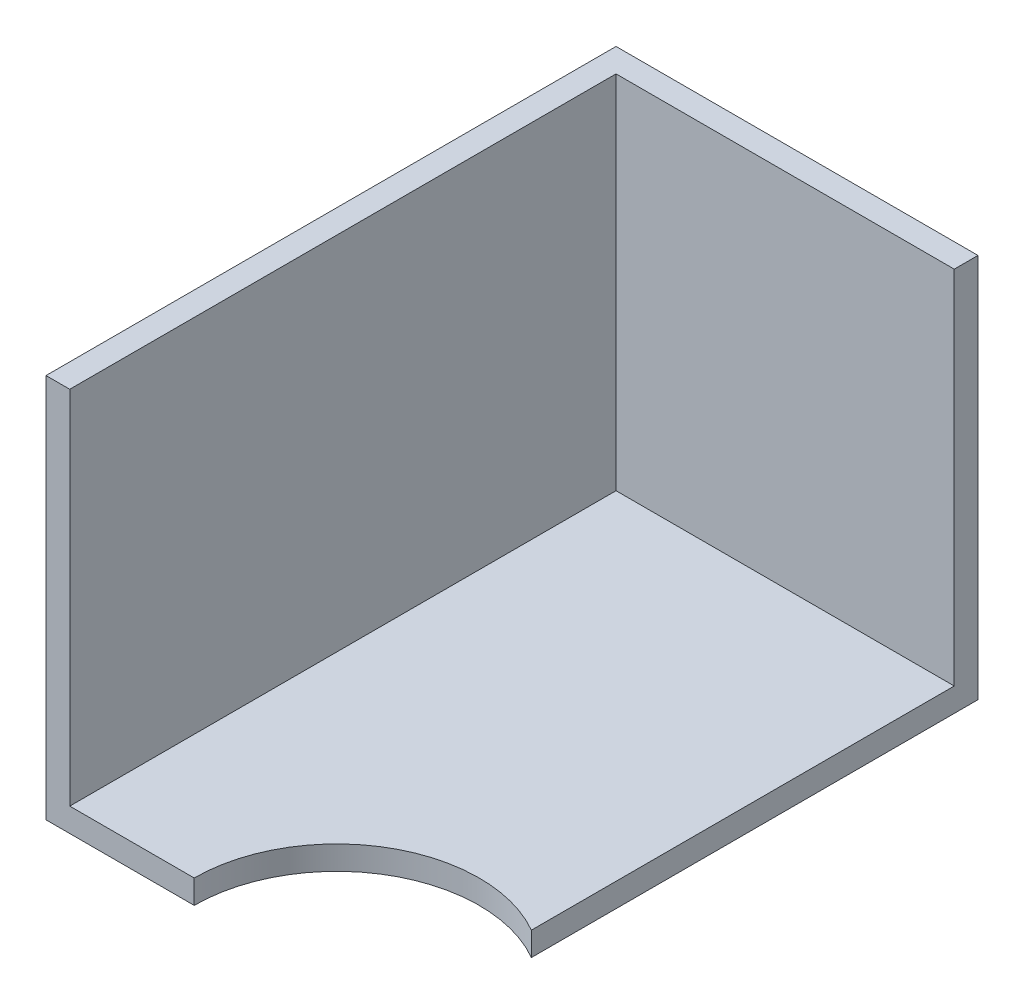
ISO-10303-21;
HEADER;
FILE_DESCRIPTION(('STEP AP214'),'2;1');
FILE_NAME('part.step','',(''),(''),'','','');
FILE_SCHEMA(('AUTOMOTIVE_DESIGN { 1 0 10303 214 1 1 1 1 }'));
ENDSEC;
DATA;
#1=APPLICATION_CONTEXT('core data for automotive mechanical design processes');
#2=APPLICATION_PROTOCOL_DEFINITION('international standard','automotive_design',2000,#1);
#3=PRODUCT_CONTEXT('',#1,'mechanical');
#4=PRODUCT('Part','Part','',(#3));
#5=PRODUCT_RELATED_PRODUCT_CATEGORY('part','',(#4));
#6=PRODUCT_DEFINITION_FORMATION('','',#4);
#7=PRODUCT_DEFINITION_CONTEXT('part definition',#1,'design');
#8=PRODUCT_DEFINITION('design','',#6,#7);
#9=PRODUCT_DEFINITION_SHAPE('','',#8);
#10=(LENGTH_UNIT() NAMED_UNIT(*) SI_UNIT(.MILLI.,.METRE.));
#11=(NAMED_UNIT(*) PLANE_ANGLE_UNIT() SI_UNIT($,.RADIAN.));
#12=(NAMED_UNIT(*) SI_UNIT($,.STERADIAN.) SOLID_ANGLE_UNIT());
#13=UNCERTAINTY_MEASURE_WITH_UNIT(LENGTH_MEASURE(1.E-05),#10,'distance_accuracy_value','');
#14=(GEOMETRIC_REPRESENTATION_CONTEXT(3) GLOBAL_UNCERTAINTY_ASSIGNED_CONTEXT((#13)) GLOBAL_UNIT_ASSIGNED_CONTEXT((#10,
#11,#12)) REPRESENTATION_CONTEXT('',''));
#15=CARTESIAN_POINT('',(0.,0.,0.));
#16=DIRECTION('',(0.,0.,1.));
#17=DIRECTION('',(1.,0.,0.));
#18=AXIS2_PLACEMENT_3D('',#15,#16,#17);
#19=CARTESIAN_POINT('',(-38.1,5.,60.));
#20=DIRECTION('',(1.,0.,0.));
#21=DIRECTION('',(0.,0.,-1.));
#22=AXIS2_PLACEMENT_3D('',#19,#20,#21);
#23=PLANE('',#22);
#24=DIRECTION('',(0.,0.,1.));
#25=VECTOR('',#24,1.);
#26=CARTESIAN_POINT('',(-38.1,0.,60.));
#27=LINE('',#26,#25);
#28=CARTESIAN_POINT('',(-38.1,0.,-60.));
#29=VERTEX_POINT('',#28);
#30=CARTESIAN_POINT('',(-38.1,0.,60.));
#31=VERTEX_POINT('',#30);
#32=EDGE_CURVE('E121',#29,#31,#27,.T.);
#33=ORIENTED_EDGE('',*,*,#32,.T.);
#34=DIRECTION('',(0.,-1.,0.));
#35=VECTOR('',#34,1.);
#36=CARTESIAN_POINT('',(-38.1,5.,60.));
#37=LINE('',#36,#35);
#38=CARTESIAN_POINT('',(-38.1,81.,60.));
#39=VERTEX_POINT('',#38);
#40=EDGE_CURVE('E11',#39,#31,#37,.T.);
#41=ORIENTED_EDGE('',*,*,#40,.F.);
#42=DIRECTION('',(0.,0.,1.));
#43=VECTOR('',#42,1.);
#44=CARTESIAN_POINT('',(-38.1,81.,60.));
#45=LINE('',#44,#43);
#46=CARTESIAN_POINT('',(-38.1,81.,-60.));
#47=VERTEX_POINT('',#46);
#48=EDGE_CURVE('E158',#47,#39,#45,.T.);
#49=ORIENTED_EDGE('',*,*,#48,.F.);
#50=DIRECTION('',(0.,-1.,0.));
#51=VECTOR('',#50,1.);
#52=CARTESIAN_POINT('',(-38.1,5.,-60.));
#53=LINE('',#52,#51);
#54=EDGE_CURVE('E125',#47,#29,#53,.T.);
#55=ORIENTED_EDGE('',*,*,#54,.T.);
#56=EDGE_LOOP('',(#33,#41,#49,#55));
#57=FACE_BOUND('',#56,.T.);
#58=ADVANCED_FACE('F34',(#57),#23,.F.);
#59=CARTESIAN_POINT('',(38.1,5.,60.));
#60=DIRECTION('',(0.,0.,-1.));
#61=DIRECTION('',(-1.,0.,0.));
#62=AXIS2_PLACEMENT_3D('',#59,#60,#61);
#63=PLANE('',#62);
#64=DIRECTION('',(1.,0.,0.));
#65=VECTOR('',#64,1.);
#66=CARTESIAN_POINT('',(38.1,0.,60.));
#67=LINE('',#66,#65);
#68=CARTESIAN_POINT('',(-6.89999999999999,0.,60.));
#69=VERTEX_POINT('',#68);
#70=EDGE_CURVE('E117',#31,#69,#67,.T.);
#71=ORIENTED_EDGE('',*,*,#70,.T.);
#72=DIRECTION('',(0.,1.,0.));
#73=VECTOR('',#72,1.);
#74=CARTESIAN_POINT('',(-6.89999999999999,0.,60.));
#75=LINE('',#74,#73);
#76=CARTESIAN_POINT('',(-6.89999999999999,5.,60.));
#77=VERTEX_POINT('',#76);
#78=EDGE_CURVE('E51',#69,#77,#75,.T.);
#79=ORIENTED_EDGE('',*,*,#78,.T.);
#80=DIRECTION('',(1.,0.,0.));
#81=VECTOR('',#80,1.);
#82=CARTESIAN_POINT('',(38.1,5.,60.));
#83=LINE('',#82,#81);
#84=CARTESIAN_POINT('',(-33.0999999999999,5.,60.));
#85=VERTEX_POINT('',#84);
#86=EDGE_CURVE('E119',#85,#77,#83,.T.);
#87=ORIENTED_EDGE('',*,*,#86,.F.);
#88=DIRECTION('',(0.,-1.,0.));
#89=VECTOR('',#88,1.);
#90=CARTESIAN_POINT('',(-33.1,81.,60.));
#91=LINE('',#90,#89);
#92=CARTESIAN_POINT('',(-33.1,81.,60.));
#93=VERTEX_POINT('',#92);
#94=EDGE_CURVE('E140',#93,#85,#91,.T.);
#95=ORIENTED_EDGE('',*,*,#94,.F.);
#96=DIRECTION('',(1.,0.,0.));
#97=VECTOR('',#96,1.);
#98=CARTESIAN_POINT('',(-33.1,81.,60.));
#99=LINE('',#98,#97);
#100=EDGE_CURVE('E155',#39,#93,#99,.T.);
#101=ORIENTED_EDGE('',*,*,#100,.F.);
#102=ORIENTED_EDGE('',*,*,#40,.T.);
#103=EDGE_LOOP('',(#71,#79,#87,#95,#101,#102));
#104=FACE_BOUND('',#103,.T.);
#105=ADVANCED_FACE('F176',(#104),#63,.F.);
#106=CARTESIAN_POINT('',(38.1,5.,60.));
#107=DIRECTION('',(-1.,0.,0.));
#108=DIRECTION('',(0.,0.,1.));
#109=AXIS2_PLACEMENT_3D('',#106,#107,#108);
#110=PLANE('',#109);
#111=DIRECTION('',(0.,0.,-1.));
#112=VECTOR('',#111,1.);
#113=CARTESIAN_POINT('',(38.1,5.,60.));
#114=LINE('',#113,#112);
#115=CARTESIAN_POINT('',(38.1,5.,34.0192378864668));
#116=VERTEX_POINT('',#115);
#117=CARTESIAN_POINT('',(38.1,5.,-55.));
#118=VERTEX_POINT('',#117);
#119=EDGE_CURVE('E37',#116,#118,#114,.T.);
#120=ORIENTED_EDGE('',*,*,#119,.F.);
#121=DIRECTION('',(0.,1.,0.));
#122=VECTOR('',#121,1.);
#123=CARTESIAN_POINT('',(38.1,0.,34.0192378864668));
#124=LINE('',#123,#122);
#125=CARTESIAN_POINT('',(38.1,0.,34.0192378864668));
#126=VERTEX_POINT('',#125);
#127=EDGE_CURVE('E101',#116,#126,#124,.F.);
#128=ORIENTED_EDGE('',*,*,#127,.T.);
#129=DIRECTION('',(0.,0.,-1.));
#130=VECTOR('',#129,1.);
#131=CARTESIAN_POINT('',(38.1,0.,60.));
#132=LINE('',#131,#130);
#133=CARTESIAN_POINT('',(38.1,0.,-60.));
#134=VERTEX_POINT('',#133);
#135=EDGE_CURVE('E109',#126,#134,#132,.T.);
#136=ORIENTED_EDGE('',*,*,#135,.T.);
#137=DIRECTION('',(0.,-1.,0.));
#138=VECTOR('',#137,1.);
#139=CARTESIAN_POINT('',(38.1,5.,-60.));
#140=LINE('',#139,#138);
#141=CARTESIAN_POINT('',(38.1,81.,-60.));
#142=VERTEX_POINT('',#141);
#143=EDGE_CURVE('E43',#142,#134,#140,.T.);
#144=ORIENTED_EDGE('',*,*,#143,.F.);
#145=DIRECTION('',(0.,0.,-1.));
#146=VECTOR('',#145,1.);
#147=CARTESIAN_POINT('',(38.1,81.,-60.));
#148=LINE('',#147,#146);
#149=CARTESIAN_POINT('',(38.1,81.,-55.));
#150=VERTEX_POINT('',#149);
#151=EDGE_CURVE('E164',#150,#142,#148,.T.);
#152=ORIENTED_EDGE('',*,*,#151,.F.);
#153=DIRECTION('',(0.,-1.,0.));
#154=VECTOR('',#153,1.);
#155=CARTESIAN_POINT('',(38.1,81.,-55.));
#156=LINE('',#155,#154);
#157=EDGE_CURVE('E148',#150,#118,#156,.T.);
#158=ORIENTED_EDGE('',*,*,#157,.T.);
#159=EDGE_LOOP('',(#120,#128,#136,#144,#152,#158));
#160=FACE_BOUND('',#159,.T.);
#161=ADVANCED_FACE('F108',(#160),#110,.F.);
#162=CARTESIAN_POINT('',(38.1,5.,-60.));
#163=DIRECTION('',(0.,0.,1.));
#164=DIRECTION('',(1.,0.,0.));
#165=AXIS2_PLACEMENT_3D('',#162,#163,#164);
#166=PLANE('',#165);
#167=DIRECTION('',(-1.,0.,0.));
#168=VECTOR('',#167,1.);
#169=CARTESIAN_POINT('',(38.1,0.,-60.));
#170=LINE('',#169,#168);
#171=EDGE_CURVE('E116',#134,#29,#170,.T.);
#172=ORIENTED_EDGE('',*,*,#171,.T.);
#173=ORIENTED_EDGE('',*,*,#54,.F.);
#174=DIRECTION('',(-1.,0.,0.));
#175=VECTOR('',#174,1.);
#176=CARTESIAN_POINT('',(-38.1,81.,-60.));
#177=LINE('',#176,#175);
#178=EDGE_CURVE('E161',#142,#47,#177,.T.);
#179=ORIENTED_EDGE('',*,*,#178,.F.);
#180=ORIENTED_EDGE('',*,*,#143,.T.);
#181=EDGE_LOOP('',(#172,#173,#179,#180));
#182=FACE_BOUND('',#181,.T.);
#183=ADVANCED_FACE('F191',(#182),#166,.F.);
#184=CARTESIAN_POINT('',(0.,5.,0.));
#185=DIRECTION('',(0.,1.,0.));
#186=DIRECTION('',(0.,0.,1.));
#187=AXIS2_PLACEMENT_3D('',#184,#185,#186);
#188=PLANE('',#187);
#189=CARTESIAN_POINT('',(23.1,5.,60.));
#190=DIRECTION('',(0.,1.,0.));
#191=DIRECTION('',(0.,0.,1.));
#192=AXIS2_PLACEMENT_3D('',#189,#190,#191);
#193=CIRCLE('',#192,30.);
#194=EDGE_CURVE('E105',#116,#77,#193,.T.);
#195=ORIENTED_EDGE('',*,*,#194,.F.);
#196=ORIENTED_EDGE('',*,*,#119,.T.);
#197=DIRECTION('',(1.,0.,0.));
#198=VECTOR('',#197,1.);
#199=CARTESIAN_POINT('',(38.1,5.,-55.));
#200=LINE('',#199,#198);
#201=CARTESIAN_POINT('',(-33.1,5.,-55.));
#202=VERTEX_POINT('',#201);
#203=EDGE_CURVE('E153',#202,#118,#200,.T.);
#204=ORIENTED_EDGE('',*,*,#203,.F.);
#205=DIRECTION('',(0.,0.,-1.));
#206=VECTOR('',#205,1.);
#207=CARTESIAN_POINT('',(-33.1,5.,-55.));
#208=LINE('',#207,#206);
#209=EDGE_CURVE('E132',#85,#202,#208,.T.);
#210=ORIENTED_EDGE('',*,*,#209,.F.);
#211=ORIENTED_EDGE('',*,*,#86,.T.);
#212=EDGE_LOOP('',(#195,#196,#204,#210,#211));
#213=FACE_BOUND('',#212,.T.);
#214=ADVANCED_FACE('F177',(#213),#188,.T.);
#215=CARTESIAN_POINT('',(0.,0.,0.));
#216=DIRECTION('',(0.,1.,0.));
#217=DIRECTION('',(0.,0.,1.));
#218=AXIS2_PLACEMENT_3D('',#215,#216,#217);
#219=PLANE('',#218);
#220=ORIENTED_EDGE('',*,*,#135,.F.);
#221=CARTESIAN_POINT('',(23.1,0.,60.));
#222=DIRECTION('',(0.,1.,0.));
#223=DIRECTION('',(0.,0.,1.));
#224=AXIS2_PLACEMENT_3D('',#221,#222,#223);
#225=CIRCLE('',#224,30.);
#226=EDGE_CURVE('E98',#126,#69,#225,.T.);
#227=ORIENTED_EDGE('',*,*,#226,.T.);
#228=ORIENTED_EDGE('',*,*,#70,.F.);
#229=ORIENTED_EDGE('',*,*,#32,.F.);
#230=ORIENTED_EDGE('',*,*,#171,.F.);
#231=EDGE_LOOP('',(#220,#227,#228,#229,#230));
#232=FACE_BOUND('',#231,.T.);
#233=ADVANCED_FACE('F114',(#232),#219,.F.);
#234=CARTESIAN_POINT('',(-33.1,81.,-55.));
#235=DIRECTION('',(-1.,0.,0.));
#236=DIRECTION('',(0.,0.,1.));
#237=AXIS2_PLACEMENT_3D('',#234,#235,#236);
#238=PLANE('',#237);
#239=ORIENTED_EDGE('',*,*,#209,.T.);
#240=DIRECTION('',(0.,-1.,0.));
#241=VECTOR('',#240,1.);
#242=CARTESIAN_POINT('',(-33.1,81.,-55.));
#243=LINE('',#242,#241);
#244=CARTESIAN_POINT('',(-33.1,81.,-55.));
#245=VERTEX_POINT('',#244);
#246=EDGE_CURVE('E136',#245,#202,#243,.T.);
#247=ORIENTED_EDGE('',*,*,#246,.F.);
#248=DIRECTION('',(0.,0.,-1.));
#249=VECTOR('',#248,1.);
#250=CARTESIAN_POINT('',(-33.1,81.,-55.));
#251=LINE('',#250,#249);
#252=EDGE_CURVE('E169',#93,#245,#251,.T.);
#253=ORIENTED_EDGE('',*,*,#252,.F.);
#254=ORIENTED_EDGE('',*,*,#94,.T.);
#255=EDGE_LOOP('',(#239,#247,#253,#254));
#256=FACE_BOUND('',#255,.T.);
#257=ADVANCED_FACE('F179',(#256),#238,.F.);
#258=CARTESIAN_POINT('',(38.1,81.,-55.));
#259=DIRECTION('',(0.,0.,-1.));
#260=DIRECTION('',(-1.,0.,0.));
#261=AXIS2_PLACEMENT_3D('',#258,#259,#260);
#262=PLANE('',#261);
#263=ORIENTED_EDGE('',*,*,#203,.T.);
#264=ORIENTED_EDGE('',*,*,#157,.F.);
#265=DIRECTION('',(1.,0.,0.));
#266=VECTOR('',#265,1.);
#267=CARTESIAN_POINT('',(38.1,81.,-55.));
#268=LINE('',#267,#266);
#269=EDGE_CURVE('E167',#245,#150,#268,.T.);
#270=ORIENTED_EDGE('',*,*,#269,.F.);
#271=ORIENTED_EDGE('',*,*,#246,.T.);
#272=EDGE_LOOP('',(#263,#264,#270,#271));
#273=FACE_BOUND('',#272,.T.);
#274=ADVANCED_FACE('F182',(#273),#262,.F.);
#275=CARTESIAN_POINT('',(0.,81.,0.));
#276=DIRECTION('',(0.,-1.,0.));
#277=DIRECTION('',(0.,0.,-1.));
#278=AXIS2_PLACEMENT_3D('',#275,#276,#277);
#279=PLANE('',#278);
#280=ORIENTED_EDGE('',*,*,#100,.T.);
#281=ORIENTED_EDGE('',*,*,#252,.T.);
#282=ORIENTED_EDGE('',*,*,#269,.T.);
#283=ORIENTED_EDGE('',*,*,#151,.T.);
#284=ORIENTED_EDGE('',*,*,#178,.T.);
#285=ORIENTED_EDGE('',*,*,#48,.T.);
#286=EDGE_LOOP('',(#280,#281,#282,#283,#284,#285));
#287=FACE_BOUND('',#286,.T.);
#288=ADVANCED_FACE('F186',(#287),#279,.F.);
#289=CARTESIAN_POINT('',(23.1,0.,60.));
#290=DIRECTION('',(0.,1.,0.));
#291=DIRECTION('',(0.,0.,1.));
#292=AXIS2_PLACEMENT_3D('',#289,#290,#291);
#293=CYLINDRICAL_SURFACE('',#292,30.);
#294=ORIENTED_EDGE('',*,*,#226,.F.);
#295=ORIENTED_EDGE('',*,*,#127,.F.);
#296=ORIENTED_EDGE('',*,*,#194,.T.);
#297=ORIENTED_EDGE('',*,*,#78,.F.);
#298=EDGE_LOOP('',(#294,#295,#296,#297));
#299=FACE_BOUND('',#298,.T.);
#300=ADVANCED_FACE('F100',(#299),#293,.F.);
#301=CLOSED_SHELL('',(#58,#105,#161,#183,#214,#233,#257,#274,#288,#300));
#302=MANIFOLD_SOLID_BREP('B2',#301);
#303=ADVANCED_BREP_SHAPE_REPRESENTATION('',(#18,#302),#14);
#304=SHAPE_DEFINITION_REPRESENTATION(#9,#303);
ENDSEC;
END-ISO-10303-21;
